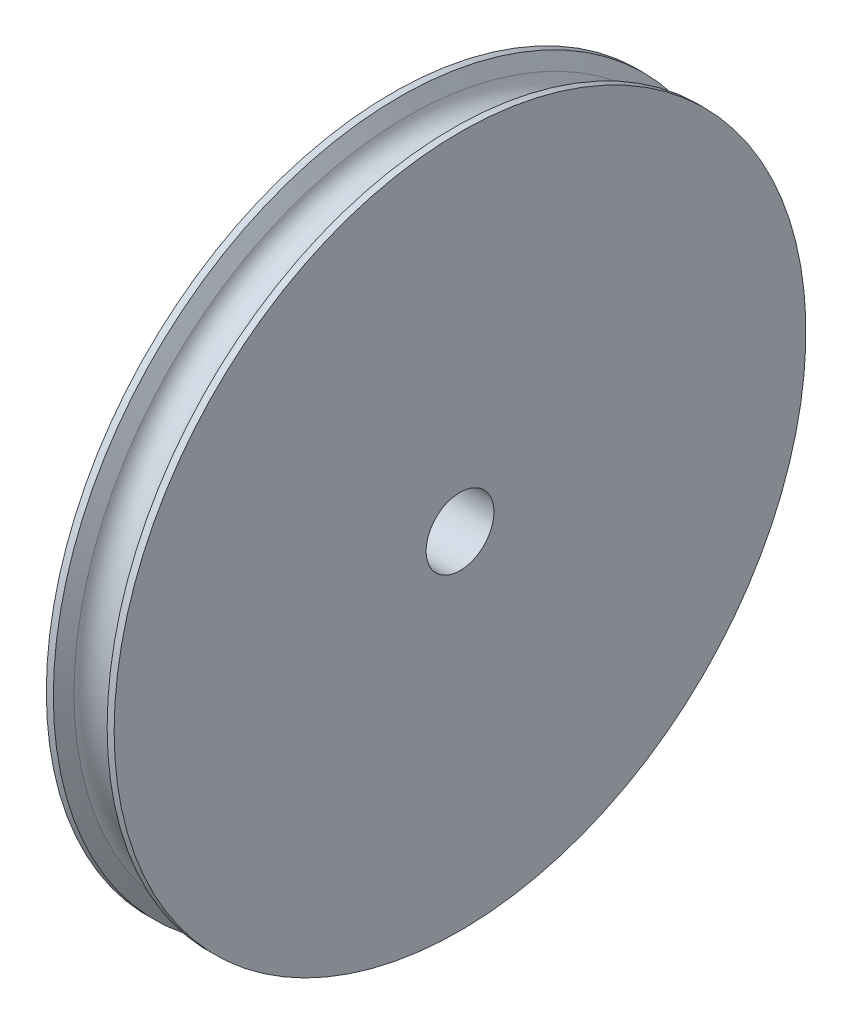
ISO-10303-21;
HEADER;
FILE_DESCRIPTION(('STEP AP214'),'2;1');
FILE_NAME('part.step','',(''),(''),'','','');
FILE_SCHEMA(('AUTOMOTIVE_DESIGN { 1 0 10303 214 1 1 1 1 }'));
ENDSEC;
DATA;
#1=APPLICATION_CONTEXT('core data for automotive mechanical design processes');
#2=APPLICATION_PROTOCOL_DEFINITION('international standard','automotive_design',2000,#1);
#3=PRODUCT_CONTEXT('',#1,'mechanical');
#4=PRODUCT('Part','Part','',(#3));
#5=PRODUCT_RELATED_PRODUCT_CATEGORY('part','',(#4));
#6=PRODUCT_DEFINITION_FORMATION('','',#4);
#7=PRODUCT_DEFINITION_CONTEXT('part definition',#1,'design');
#8=PRODUCT_DEFINITION('design','',#6,#7);
#9=PRODUCT_DEFINITION_SHAPE('','',#8);
#10=(LENGTH_UNIT() NAMED_UNIT(*) SI_UNIT(.MILLI.,.METRE.));
#11=(NAMED_UNIT(*) PLANE_ANGLE_UNIT() SI_UNIT($,.RADIAN.));
#12=(NAMED_UNIT(*) SI_UNIT($,.STERADIAN.) SOLID_ANGLE_UNIT());
#13=UNCERTAINTY_MEASURE_WITH_UNIT(LENGTH_MEASURE(1.E-05),#10,'distance_accuracy_value','');
#14=(GEOMETRIC_REPRESENTATION_CONTEXT(3) GLOBAL_UNCERTAINTY_ASSIGNED_CONTEXT((#13)) GLOBAL_UNIT_ASSIGNED_CONTEXT((#10,
#11,#12)) REPRESENTATION_CONTEXT('',''));
#15=CARTESIAN_POINT('',(0.,0.,0.));
#16=DIRECTION('',(0.,0.,1.));
#17=DIRECTION('',(1.,0.,0.));
#18=AXIS2_PLACEMENT_3D('',#15,#16,#17);
#19=CARTESIAN_POINT('',(3.96811878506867,0.,0.));
#20=DIRECTION('',(1.,0.,0.));
#21=DIRECTION('',(0.,1.,0.));
#22=AXIS2_PLACEMENT_3D('',#19,#20,#21);
#23=CONICAL_SURFACE('',#22,51.,1.0471975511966);
#24=CARTESIAN_POINT('',(3.96811878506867,0.,0.));
#25=DIRECTION('',(-1.,0.,0.));
#26=DIRECTION('',(0.,0.,1.));
#27=AXIS2_PLACEMENT_3D('',#24,#25,#26);
#28=CIRCLE('',#27,51.);
#29=CARTESIAN_POINT('',(3.96811878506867,0.,51.));
#30=VERTEX_POINT('',#29);
#31=EDGE_CURVE('E145',#30,#30,#28,.F.);
#32=ORIENTED_EDGE('',*,*,#31,.F.);
#33=EDGE_LOOP('',(#32));
#34=FACE_BOUND('',#33,.T.);
#35=CARTESIAN_POINT('',(2.85008479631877,0.,0.));
#36=DIRECTION('',(1.,0.,0.));
#37=DIRECTION('',(0.,0.,-1.));
#38=AXIS2_PLACEMENT_3D('',#35,#36,#37);
#39=CIRCLE('',#38,49.0635083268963);
#40=CARTESIAN_POINT('',(2.85008479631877,0.,-49.0635083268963));
#41=VERTEX_POINT('',#40);
#42=EDGE_CURVE('E43',#41,#41,#39,.T.);
#43=ORIENTED_EDGE('',*,*,#42,.T.);
#44=EDGE_LOOP('',(#43));
#45=FACE_BOUND('',#44,.T.);
#46=ADVANCED_FACE('F14',(#34,#45),#23,.T.);
#47=CARTESIAN_POINT('',(5.,0.,0.));
#48=DIRECTION('',(-1.,0.,0.));
#49=DIRECTION('',(0.,0.,1.));
#50=AXIS2_PLACEMENT_3D('',#47,#48,#49);
#51=CYLINDRICAL_SURFACE('',#50,51.);
#52=CARTESIAN_POINT('',(5.,0.,0.));
#53=DIRECTION('',(-1.,0.,0.));
#54=DIRECTION('',(0.,0.,1.));
#55=AXIS2_PLACEMENT_3D('',#52,#53,#54);
#56=CIRCLE('',#55,51.);
#57=CARTESIAN_POINT('',(5.,0.,51.));
#58=VERTEX_POINT('',#57);
#59=EDGE_CURVE('E17',#58,#58,#56,.F.);
#60=ORIENTED_EDGE('',*,*,#59,.F.);
#61=EDGE_LOOP('',(#60));
#62=FACE_BOUND('',#61,.T.);
#63=ORIENTED_EDGE('',*,*,#31,.T.);
#64=EDGE_LOOP('',(#63));
#65=FACE_BOUND('',#64,.T.);
#66=ADVANCED_FACE('F57',(#62,#65),#51,.T.);
#67=CARTESIAN_POINT('',(0.,0.,0.));
#68=DIRECTION('',(1.,0.,0.));
#69=DIRECTION('',(0.,0.,-1.));
#70=AXIS2_PLACEMENT_3D('',#67,#68,#69);
#71=TOROIDAL_SURFACE('',#70,50.,3.);
#72=CARTESIAN_POINT('',(-2.85008479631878,0.,0.));
#73=DIRECTION('',(-1.,0.,0.));
#74=DIRECTION('',(0.,0.,1.));
#75=AXIS2_PLACEMENT_3D('',#72,#73,#74);
#76=CIRCLE('',#75,49.0635083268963);
#77=CARTESIAN_POINT('',(-2.85008479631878,0.,49.0635083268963));
#78=VERTEX_POINT('',#77);
#79=EDGE_CURVE('E33',#78,#78,#76,.T.);
#80=ORIENTED_EDGE('',*,*,#79,.F.);
#81=EDGE_LOOP('',(#80));
#82=FACE_BOUND('',#81,.T.);
#83=ORIENTED_EDGE('',*,*,#42,.F.);
#84=EDGE_LOOP('',(#83));
#85=FACE_BOUND('',#84,.T.);
#86=ADVANCED_FACE('F53',(#82,#85),#71,.F.);
#87=CARTESIAN_POINT('',(5.,5.,0.));
#88=DIRECTION('',(1.,0.,0.));
#89=DIRECTION('',(0.,0.,-1.));
#90=AXIS2_PLACEMENT_3D('',#87,#88,#89);
#91=PLANE('',#90);
#92=CARTESIAN_POINT('',(5.,0.,0.));
#93=DIRECTION('',(-1.,0.,0.));
#94=DIRECTION('',(0.,0.,1.));
#95=AXIS2_PLACEMENT_3D('',#92,#93,#94);
#96=CIRCLE('',#95,5.);
#97=CARTESIAN_POINT('',(5.,0.,5.));
#98=VERTEX_POINT('',#97);
#99=EDGE_CURVE('E31',#98,#98,#96,.T.);
#100=ORIENTED_EDGE('',*,*,#99,.T.);
#101=EDGE_LOOP('',(#100));
#102=FACE_BOUND('',#101,.T.);
#103=ORIENTED_EDGE('',*,*,#59,.T.);
#104=EDGE_LOOP('',(#103));
#105=FACE_BOUND('',#104,.T.);
#106=ADVANCED_FACE('F56',(#102,#105),#91,.T.);
#107=CARTESIAN_POINT('',(-3.96811878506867,0.,0.));
#108=DIRECTION('',(-1.,0.,0.));
#109=DIRECTION('',(0.,0.,1.));
#110=AXIS2_PLACEMENT_3D('',#107,#108,#109);
#111=CONICAL_SURFACE('',#110,51.,1.0471975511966);
#112=ORIENTED_EDGE('',*,*,#79,.T.);
#113=EDGE_LOOP('',(#112));
#114=FACE_BOUND('',#113,.T.);
#115=CARTESIAN_POINT('',(-3.96811878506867,0.,0.));
#116=DIRECTION('',(-1.,0.,0.));
#117=DIRECTION('',(0.,0.,1.));
#118=AXIS2_PLACEMENT_3D('',#115,#116,#117);
#119=CIRCLE('',#118,51.);
#120=CARTESIAN_POINT('',(-3.96811878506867,0.,51.));
#121=VERTEX_POINT('',#120);
#122=EDGE_CURVE('E26',#121,#121,#119,.T.);
#123=ORIENTED_EDGE('',*,*,#122,.F.);
#124=EDGE_LOOP('',(#123));
#125=FACE_BOUND('',#124,.T.);
#126=ADVANCED_FACE('F82',(#114,#125),#111,.T.);
#127=CARTESIAN_POINT('',(5.,0.,0.));
#128=DIRECTION('',(-1.,0.,0.));
#129=DIRECTION('',(0.,0.,1.));
#130=AXIS2_PLACEMENT_3D('',#127,#128,#129);
#131=CYLINDRICAL_SURFACE('',#130,5.);
#132=CARTESIAN_POINT('',(-5.,0.,0.));
#133=DIRECTION('',(-1.,0.,0.));
#134=DIRECTION('',(0.,0.,1.));
#135=AXIS2_PLACEMENT_3D('',#132,#133,#134);
#136=CIRCLE('',#135,5.);
#137=CARTESIAN_POINT('',(-5.,0.,5.));
#138=VERTEX_POINT('',#137);
#139=EDGE_CURVE('E21',#138,#138,#136,.F.);
#140=ORIENTED_EDGE('',*,*,#139,.F.);
#141=EDGE_LOOP('',(#140));
#142=FACE_BOUND('',#141,.T.);
#143=ORIENTED_EDGE('',*,*,#99,.F.);
#144=EDGE_LOOP('',(#143));
#145=FACE_BOUND('',#144,.T.);
#146=ADVANCED_FACE('F76',(#142,#145),#131,.F.);
#147=CARTESIAN_POINT('',(5.,0.,0.));
#148=DIRECTION('',(-1.,0.,0.));
#149=DIRECTION('',(0.,0.,1.));
#150=AXIS2_PLACEMENT_3D('',#147,#148,#149);
#151=CYLINDRICAL_SURFACE('',#150,51.);
#152=ORIENTED_EDGE('',*,*,#122,.T.);
#153=EDGE_LOOP('',(#152));
#154=FACE_BOUND('',#153,.T.);
#155=CARTESIAN_POINT('',(-5.,0.,0.));
#156=DIRECTION('',(-1.,0.,0.));
#157=DIRECTION('',(0.,0.,1.));
#158=AXIS2_PLACEMENT_3D('',#155,#156,#157);
#159=CIRCLE('',#158,51.);
#160=CARTESIAN_POINT('',(-5.,0.,51.));
#161=VERTEX_POINT('',#160);
#162=EDGE_CURVE('E10',#161,#161,#159,.T.);
#163=ORIENTED_EDGE('',*,*,#162,.F.);
#164=EDGE_LOOP('',(#163));
#165=FACE_BOUND('',#164,.T.);
#166=ADVANCED_FACE('F71',(#154,#165),#151,.T.);
#167=CARTESIAN_POINT('',(-5.,51.,0.));
#168=DIRECTION('',(-1.,0.,0.));
#169=DIRECTION('',(0.,0.,1.));
#170=AXIS2_PLACEMENT_3D('',#167,#168,#169);
#171=PLANE('',#170);
#172=ORIENTED_EDGE('',*,*,#162,.T.);
#173=EDGE_LOOP('',(#172));
#174=FACE_BOUND('',#173,.T.);
#175=ORIENTED_EDGE('',*,*,#139,.T.);
#176=EDGE_LOOP('',(#175));
#177=FACE_BOUND('',#176,.T.);
#178=ADVANCED_FACE('F69',(#174,#177),#171,.T.);
#179=CLOSED_SHELL('',(#46,#66,#86,#106,#126,#146,#166,#178));
#180=MANIFOLD_SOLID_BREP('B1',#179);
#181=ADVANCED_BREP_SHAPE_REPRESENTATION('',(#18,#180),#14);
#182=SHAPE_DEFINITION_REPRESENTATION(#9,#181);
ENDSEC;
END-ISO-10303-21;
